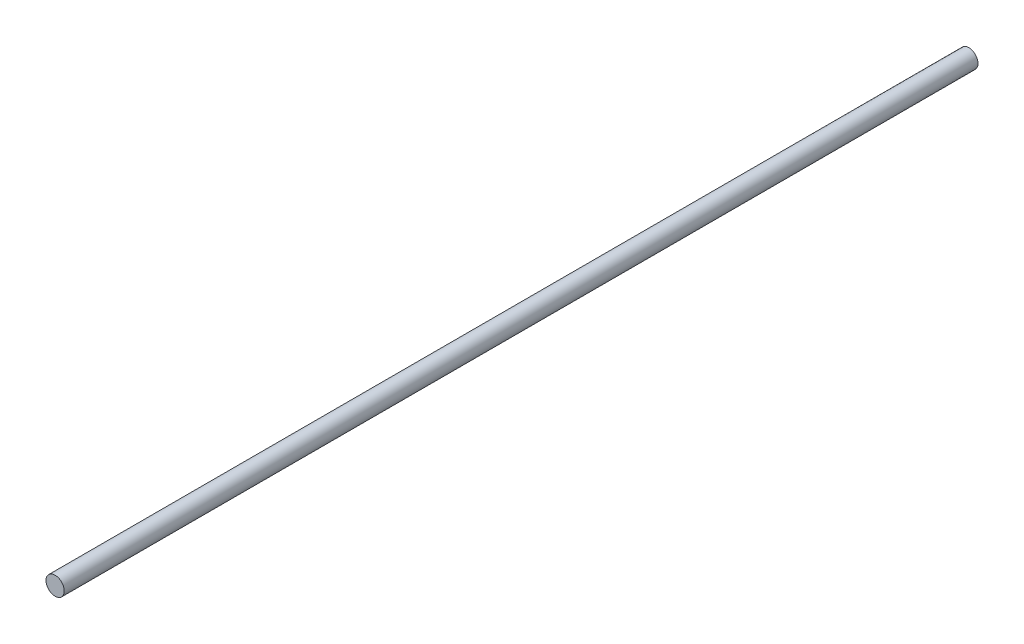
ISO-10303-21;
HEADER;
FILE_DESCRIPTION(('STEP AP214'),'2;1');
FILE_NAME('part.step','',(''),(''),'','','');
FILE_SCHEMA(('AUTOMOTIVE_DESIGN { 1 0 10303 214 1 1 1 1 }'));
ENDSEC;
DATA;
#1=APPLICATION_CONTEXT('core data for automotive mechanical design processes');
#2=APPLICATION_PROTOCOL_DEFINITION('international standard','automotive_design',2000,#1);
#3=PRODUCT_CONTEXT('',#1,'mechanical');
#4=PRODUCT('Part','Part','',(#3));
#5=PRODUCT_RELATED_PRODUCT_CATEGORY('part','',(#4));
#6=PRODUCT_DEFINITION_FORMATION('','',#4);
#7=PRODUCT_DEFINITION_CONTEXT('part definition',#1,'design');
#8=PRODUCT_DEFINITION('design','',#6,#7);
#9=PRODUCT_DEFINITION_SHAPE('','',#8);
#10=(LENGTH_UNIT() NAMED_UNIT(*) SI_UNIT(.MILLI.,.METRE.));
#11=(NAMED_UNIT(*) PLANE_ANGLE_UNIT() SI_UNIT($,.RADIAN.));
#12=(NAMED_UNIT(*) SI_UNIT($,.STERADIAN.) SOLID_ANGLE_UNIT());
#13=UNCERTAINTY_MEASURE_WITH_UNIT(LENGTH_MEASURE(1.E-05),#10,'distance_accuracy_value','');
#14=(GEOMETRIC_REPRESENTATION_CONTEXT(3) GLOBAL_UNCERTAINTY_ASSIGNED_CONTEXT((#13)) GLOBAL_UNIT_ASSIGNED_CONTEXT((#10,
#11,#12)) REPRESENTATION_CONTEXT('',''));
#15=CARTESIAN_POINT('',(0.,0.,0.));
#16=DIRECTION('',(0.,0.,1.));
#17=DIRECTION('',(1.,0.,0.));
#18=AXIS2_PLACEMENT_3D('',#15,#16,#17);
#19=CARTESIAN_POINT('',(0.,0.,400.));
#20=DIRECTION('',(0.,0.,-1.));
#21=DIRECTION('',(-1.,0.,0.));
#22=AXIS2_PLACEMENT_3D('',#19,#20,#21);
#23=CYLINDRICAL_SURFACE('',#22,4.);
#24=CARTESIAN_POINT('',(0.,0.,400.));
#25=DIRECTION('',(0.,0.,1.));
#26=DIRECTION('',(1.,0.,0.));
#27=AXIS2_PLACEMENT_3D('',#24,#25,#26);
#28=CIRCLE('',#27,4.);
#29=CARTESIAN_POINT('',(4.,0.,400.));
#30=VERTEX_POINT('',#29);
#31=EDGE_CURVE('E10',#30,#30,#28,.T.);
#32=ORIENTED_EDGE('',*,*,#31,.F.);
#33=EDGE_LOOP('',(#32));
#34=FACE_BOUND('',#33,.T.);
#35=CARTESIAN_POINT('',(0.,0.,0.));
#36=DIRECTION('',(0.,0.,1.));
#37=DIRECTION('',(1.,0.,0.));
#38=AXIS2_PLACEMENT_3D('',#35,#36,#37);
#39=CIRCLE('',#38,4.);
#40=CARTESIAN_POINT('',(4.,0.,0.));
#41=VERTEX_POINT('',#40);
#42=EDGE_CURVE('E44',#41,#41,#39,.T.);
#43=ORIENTED_EDGE('',*,*,#42,.T.);
#44=EDGE_LOOP('',(#43));
#45=FACE_BOUND('',#44,.T.);
#46=ADVANCED_FACE('F41',(#34,#45),#23,.T.);
#47=CARTESIAN_POINT('',(0.,0.,400.));
#48=DIRECTION('',(0.,0.,1.));
#49=DIRECTION('',(1.,0.,0.));
#50=AXIS2_PLACEMENT_3D('',#47,#48,#49);
#51=PLANE('',#50);
#52=ORIENTED_EDGE('',*,*,#31,.T.);
#53=EDGE_LOOP('',(#52));
#54=FACE_BOUND('',#53,.T.);
#55=ADVANCED_FACE('F58',(#54),#51,.T.);
#56=CARTESIAN_POINT('',(0.,0.,0.));
#57=DIRECTION('',(0.,0.,1.));
#58=DIRECTION('',(1.,0.,0.));
#59=AXIS2_PLACEMENT_3D('',#56,#57,#58);
#60=PLANE('',#59);
#61=ORIENTED_EDGE('',*,*,#42,.F.);
#62=EDGE_LOOP('',(#61));
#63=FACE_BOUND('',#62,.T.);
#64=ADVANCED_FACE('F56',(#63),#60,.F.);
#65=CLOSED_SHELL('',(#46,#55,#64));
#66=MANIFOLD_SOLID_BREP('B2',#65);
#67=ADVANCED_BREP_SHAPE_REPRESENTATION('',(#18,#66),#14);
#68=SHAPE_DEFINITION_REPRESENTATION(#9,#67);
ENDSEC;
END-ISO-10303-21;
